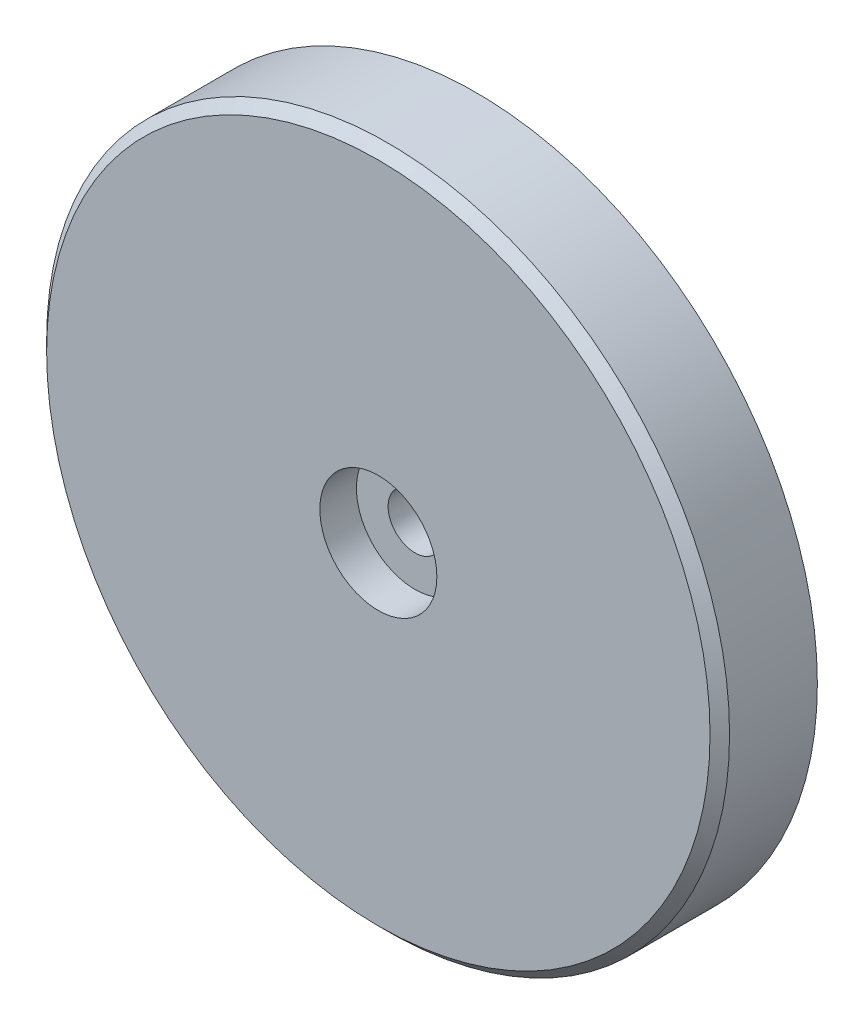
ISO-10303-21;
HEADER;
FILE_DESCRIPTION(('STEP AP214'),'2;1');
FILE_NAME('part.step','',(''),(''),'','','');
FILE_SCHEMA(('AUTOMOTIVE_DESIGN { 1 0 10303 214 1 1 1 1 }'));
ENDSEC;
DATA;
#1=APPLICATION_CONTEXT('core data for automotive mechanical design processes');
#2=APPLICATION_PROTOCOL_DEFINITION('international standard','automotive_design',2000,#1);
#3=PRODUCT_CONTEXT('',#1,'mechanical');
#4=PRODUCT('Part','Part','',(#3));
#5=PRODUCT_RELATED_PRODUCT_CATEGORY('part','',(#4));
#6=PRODUCT_DEFINITION_FORMATION('','',#4);
#7=PRODUCT_DEFINITION_CONTEXT('part definition',#1,'design');
#8=PRODUCT_DEFINITION('design','',#6,#7);
#9=PRODUCT_DEFINITION_SHAPE('','',#8);
#10=(LENGTH_UNIT() NAMED_UNIT(*) SI_UNIT(.MILLI.,.METRE.));
#11=(NAMED_UNIT(*) PLANE_ANGLE_UNIT() SI_UNIT($,.RADIAN.));
#12=(NAMED_UNIT(*) SI_UNIT($,.STERADIAN.) SOLID_ANGLE_UNIT());
#13=UNCERTAINTY_MEASURE_WITH_UNIT(LENGTH_MEASURE(1.E-05),#10,'distance_accuracy_value','');
#14=(GEOMETRIC_REPRESENTATION_CONTEXT(3) GLOBAL_UNCERTAINTY_ASSIGNED_CONTEXT((#13)) GLOBAL_UNIT_ASSIGNED_CONTEXT((#10,
#11,#12)) REPRESENTATION_CONTEXT('',''));
#15=CARTESIAN_POINT('',(0.,0.,0.));
#16=DIRECTION('',(0.,0.,1.));
#17=DIRECTION('',(1.,0.,0.));
#18=AXIS2_PLACEMENT_3D('',#15,#16,#17);
#19=CARTESIAN_POINT('',(0.,0.,0.));
#20=DIRECTION('',(0.,0.,1.));
#21=DIRECTION('',(1.,0.,0.));
#22=AXIS2_PLACEMENT_3D('',#19,#20,#21);
#23=PLANE('',#22);
#24=CARTESIAN_POINT('',(0.,0.,0.));
#25=DIRECTION('',(0.,0.,1.));
#26=DIRECTION('',(1.,0.,0.));
#27=AXIS2_PLACEMENT_3D('',#24,#25,#26);
#28=CIRCLE('',#27,70.);
#29=CARTESIAN_POINT('',(70.,0.,0.));
#30=VERTEX_POINT('',#29);
#31=EDGE_CURVE('E54',#30,#30,#28,.T.);
#32=ORIENTED_EDGE('',*,*,#31,.F.);
#33=EDGE_LOOP('',(#32));
#34=FACE_BOUND('',#33,.T.);
#35=CARTESIAN_POINT('',(0.,0.,0.));
#36=DIRECTION('',(0.,0.,1.));
#37=DIRECTION('',(1.,0.,0.));
#38=AXIS2_PLACEMENT_3D('',#35,#36,#37);
#39=CIRCLE('',#38,20.);
#40=CARTESIAN_POINT('',(20.,0.,0.));
#41=VERTEX_POINT('',#40);
#42=EDGE_CURVE('E42',#41,#41,#39,.F.);
#43=ORIENTED_EDGE('',*,*,#42,.F.);
#44=EDGE_LOOP('',(#43));
#45=FACE_BOUND('',#44,.T.);
#46=ADVANCED_FACE('F31',(#34,#45),#23,.F.);
#47=CARTESIAN_POINT('',(0.,0.,20.));
#48=DIRECTION('',(0.,0.,-1.));
#49=DIRECTION('',(-1.,0.,0.));
#50=AXIS2_PLACEMENT_3D('',#47,#48,#49);
#51=CYLINDRICAL_SURFACE('',#50,70.);
#52=CARTESIAN_POINT('',(0.,0.,18.));
#53=DIRECTION('',(0.,0.,1.));
#54=DIRECTION('',(1.,0.,0.));
#55=AXIS2_PLACEMENT_3D('',#52,#53,#54);
#56=CIRCLE('',#55,70.);
#57=CARTESIAN_POINT('',(70.,0.,18.));
#58=VERTEX_POINT('',#57);
#59=EDGE_CURVE('E46',#58,#58,#56,.F.);
#60=ORIENTED_EDGE('',*,*,#59,.T.);
#61=EDGE_LOOP('',(#60));
#62=FACE_BOUND('',#61,.T.);
#63=ORIENTED_EDGE('',*,*,#31,.T.);
#64=EDGE_LOOP('',(#63));
#65=FACE_BOUND('',#64,.T.);
#66=ADVANCED_FACE('F94',(#62,#65),#51,.T.);
#67=CARTESIAN_POINT('',(0.,0.,20.));
#68=DIRECTION('',(0.,0.,1.));
#69=DIRECTION('',(1.,0.,0.));
#70=AXIS2_PLACEMENT_3D('',#67,#68,#69);
#71=PLANE('',#70);
#72=CARTESIAN_POINT('',(0.,0.,20.));
#73=DIRECTION('',(0.,0.,1.));
#74=DIRECTION('',(1.,0.,0.));
#75=AXIS2_PLACEMENT_3D('',#72,#73,#74);
#76=CIRCLE('',#75,12.);
#77=CARTESIAN_POINT('',(12.,0.,20.));
#78=VERTEX_POINT('',#77);
#79=EDGE_CURVE('E57',#78,#78,#76,.T.);
#80=ORIENTED_EDGE('',*,*,#79,.F.);
#81=EDGE_LOOP('',(#80));
#82=FACE_BOUND('',#81,.T.);
#83=CARTESIAN_POINT('',(0.,0.,20.));
#84=DIRECTION('',(0.,0.,1.));
#85=DIRECTION('',(1.,0.,0.));
#86=AXIS2_PLACEMENT_3D('',#83,#84,#85);
#87=CIRCLE('',#86,68.);
#88=CARTESIAN_POINT('',(68.,0.,20.));
#89=VERTEX_POINT('',#88);
#90=EDGE_CURVE('E51',#89,#89,#87,.T.);
#91=ORIENTED_EDGE('',*,*,#90,.T.);
#92=EDGE_LOOP('',(#91));
#93=FACE_BOUND('',#92,.T.);
#94=ADVANCED_FACE('F90',(#82,#93),#71,.T.);
#95=CARTESIAN_POINT('',(0.,0.,20.));
#96=DIRECTION('',(0.,0.,-1.));
#97=DIRECTION('',(-1.,0.,0.));
#98=AXIS2_PLACEMENT_3D('',#95,#96,#97);
#99=CONICAL_SURFACE('',#98,68.,0.785398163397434);
#100=ORIENTED_EDGE('',*,*,#59,.F.);
#101=EDGE_LOOP('',(#100));
#102=FACE_BOUND('',#101,.T.);
#103=ORIENTED_EDGE('',*,*,#90,.F.);
#104=EDGE_LOOP('',(#103));
#105=FACE_BOUND('',#104,.T.);
#106=ADVANCED_FACE('F93',(#102,#105),#99,.T.);
#107=CARTESIAN_POINT('',(0.,0.,-5.));
#108=DIRECTION('',(0.,0.,1.));
#109=DIRECTION('',(0.,-1.,0.));
#110=AXIS2_PLACEMENT_3D('',#107,#108,#109);
#111=CYLINDRICAL_SURFACE('',#110,20.);
#112=CARTESIAN_POINT('',(0.,0.,-3.99999999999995));
#113=DIRECTION('',(0.,0.,-1.));
#114=DIRECTION('',(0.,1.,0.));
#115=AXIS2_PLACEMENT_3D('',#112,#113,#114);
#116=CIRCLE('',#115,20.);
#117=CARTESIAN_POINT('',(0.,20.,-3.99999999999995));
#118=VERTEX_POINT('',#117);
#119=EDGE_CURVE('E10',#118,#118,#116,.F.);
#120=ORIENTED_EDGE('',*,*,#119,.T.);
#121=EDGE_LOOP('',(#120));
#122=FACE_BOUND('',#121,.T.);
#123=ORIENTED_EDGE('',*,*,#42,.T.);
#124=EDGE_LOOP('',(#123));
#125=FACE_BOUND('',#124,.T.);
#126=ADVANCED_FACE('F99',(#122,#125),#111,.T.);
#127=CARTESIAN_POINT('',(0.,0.,-5.));
#128=DIRECTION('',(0.,0.,-1.));
#129=DIRECTION('',(0.,1.,0.));
#130=AXIS2_PLACEMENT_3D('',#127,#128,#129);
#131=PLANE('',#130);
#132=CARTESIAN_POINT('',(0.,0.,-5.));
#133=DIRECTION('',(0.,0.,1.));
#134=DIRECTION('',(1.,0.,0.));
#135=AXIS2_PLACEMENT_3D('',#132,#133,#134);
#136=CIRCLE('',#135,5.49999999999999);
#137=CARTESIAN_POINT('',(5.49999999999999,0.,-5.));
#138=VERTEX_POINT('',#137);
#139=EDGE_CURVE('E66',#138,#138,#136,.T.);
#140=ORIENTED_EDGE('',*,*,#139,.T.);
#141=EDGE_LOOP('',(#140));
#142=FACE_BOUND('',#141,.T.);
#143=CARTESIAN_POINT('',(0.,0.,-5.));
#144=DIRECTION('',(0.,0.,-1.));
#145=DIRECTION('',(0.,1.,0.));
#146=AXIS2_PLACEMENT_3D('',#143,#144,#145);
#147=CIRCLE('',#146,19.);
#148=CARTESIAN_POINT('',(0.,19.,-5.));
#149=VERTEX_POINT('',#148);
#150=EDGE_CURVE('E38',#149,#149,#147,.T.);
#151=ORIENTED_EDGE('',*,*,#150,.T.);
#152=EDGE_LOOP('',(#151));
#153=FACE_BOUND('',#152,.T.);
#154=ADVANCED_FACE('F70',(#142,#153),#131,.T.);
#155=CARTESIAN_POINT('',(0.,0.,-5.));
#156=DIRECTION('',(0.,0.,1.));
#157=DIRECTION('',(0.,-1.,0.));
#158=AXIS2_PLACEMENT_3D('',#155,#156,#157);
#159=CONICAL_SURFACE('',#158,19.,0.785398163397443);
#160=ORIENTED_EDGE('',*,*,#119,.F.);
#161=EDGE_LOOP('',(#160));
#162=FACE_BOUND('',#161,.T.);
#163=ORIENTED_EDGE('',*,*,#150,.F.);
#164=EDGE_LOOP('',(#163));
#165=FACE_BOUND('',#164,.T.);
#166=ADVANCED_FACE('F33',(#162,#165),#159,.T.);
#167=CARTESIAN_POINT('',(0.,0.,20.));
#168=DIRECTION('',(0.,0.,1.));
#169=DIRECTION('',(1.,0.,0.));
#170=AXIS2_PLACEMENT_3D('',#167,#168,#169);
#171=CYLINDRICAL_SURFACE('',#170,12.);
#172=CARTESIAN_POINT('',(0.,0.,12.5));
#173=DIRECTION('',(0.,0.,1.));
#174=DIRECTION('',(1.,0.,0.));
#175=AXIS2_PLACEMENT_3D('',#172,#173,#174);
#176=CIRCLE('',#175,12.);
#177=CARTESIAN_POINT('',(12.,0.,12.5));
#178=VERTEX_POINT('',#177);
#179=EDGE_CURVE('E60',#178,#178,#176,.T.);
#180=ORIENTED_EDGE('',*,*,#179,.F.);
#181=EDGE_LOOP('',(#180));
#182=FACE_BOUND('',#181,.T.);
#183=ORIENTED_EDGE('',*,*,#79,.T.);
#184=EDGE_LOOP('',(#183));
#185=FACE_BOUND('',#184,.T.);
#186=ADVANCED_FACE('F81',(#182,#185),#171,.F.);
#187=CARTESIAN_POINT('',(5.5,0.,12.5));
#188=DIRECTION('',(0.,0.,-1.));
#189=DIRECTION('',(-1.,0.,0.));
#190=AXIS2_PLACEMENT_3D('',#187,#188,#189);
#191=PLANE('',#190);
#192=CARTESIAN_POINT('',(0.,0.,12.5));
#193=DIRECTION('',(0.,0.,1.));
#194=DIRECTION('',(1.,0.,0.));
#195=AXIS2_PLACEMENT_3D('',#192,#193,#194);
#196=CIRCLE('',#195,5.5);
#197=CARTESIAN_POINT('',(5.5,0.,12.5));
#198=VERTEX_POINT('',#197);
#199=EDGE_CURVE('E63',#198,#198,#196,.T.);
#200=ORIENTED_EDGE('',*,*,#199,.F.);
#201=EDGE_LOOP('',(#200));
#202=FACE_BOUND('',#201,.T.);
#203=ORIENTED_EDGE('',*,*,#179,.T.);
#204=EDGE_LOOP('',(#203));
#205=FACE_BOUND('',#204,.T.);
#206=ADVANCED_FACE('F75',(#202,#205),#191,.F.);
#207=CARTESIAN_POINT('',(0.,0.,20.));
#208=DIRECTION('',(0.,0.,1.));
#209=DIRECTION('',(1.,0.,0.));
#210=AXIS2_PLACEMENT_3D('',#207,#208,#209);
#211=CYLINDRICAL_SURFACE('',#210,5.5);
#212=ORIENTED_EDGE('',*,*,#139,.F.);
#213=EDGE_LOOP('',(#212));
#214=FACE_BOUND('',#213,.T.);
#215=ORIENTED_EDGE('',*,*,#199,.T.);
#216=EDGE_LOOP('',(#215));
#217=FACE_BOUND('',#216,.T.);
#218=ADVANCED_FACE('F72',(#214,#217),#211,.F.);
#219=CLOSED_SHELL('',(#46,#66,#94,#106,#126,#154,#166,#186,#206,#218));
#220=MANIFOLD_SOLID_BREP('B2',#219);
#221=ADVANCED_BREP_SHAPE_REPRESENTATION('',(#18,#220),#14);
#222=SHAPE_DEFINITION_REPRESENTATION(#9,#221);
ENDSEC;
END-ISO-10303-21;
